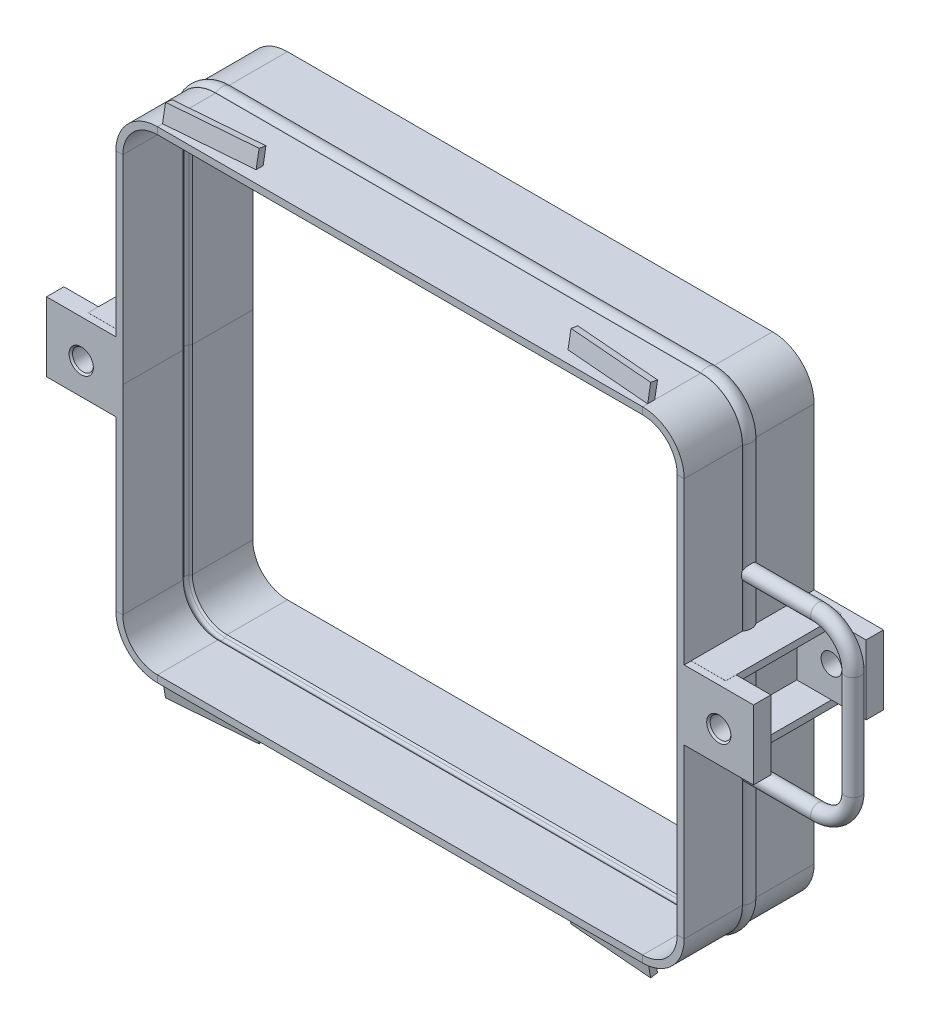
from build123d import *

# Parameters (mm, degrees)
ESQUISSE3_W          = 80
ESQUISSE3_H          = 80
ESQUISSE3_R          = 12
BOSS_EXTRU_1_DEPTH   = 20
BOSS_EXTRU_1_2_DEPTH = 20
CHANFREIN1_SIZE      = 2
CHANFREIN2_SIZE      = 2
ESQUISSE5_R          = 9
BOSS_EXTRU_2_START   = 8
BOSS_EXTRU_2_DEPTH   = 8


with BuildPart() as part:
    # Balayage1: sweep along a path in Esquisse1
    with BuildLine(Plane.XY) as balayage1_path:
        Line((280, -270), (-280, -270))
        ThreePointArc((-280, -270), (-308.284271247, -258.284271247), (-320, -230))
        Line((-320, -230), (-320, 230))
        ThreePointArc((-320, 230), (-308.284271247, 258.284271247), (-280, 270))
        Line((-280, 270), (280, 270))
        ThreePointArc((280, 270), (308.284271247, 258.284271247), (320, 230))
        Line((320, 230), (320, -230))
        ThreePointArc((320, -230), (308.284271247, -258.284271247), (280, -270))
    # Esquisse2 → Balayage1 (sweep)
    with BuildSketch(Plane(origin=(0, 0, 0), x_dir=(1, 0, 0), z_dir=(0, 1, 0))):
        with BuildLine():
            Line((-320, 5.267499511), (-320, 75))
            Line((-320, 75), (-328, 75))
            Line((-328, 75), (-328, 7.81759643))
            Line((-328, 7.81759643), (-328.208677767, 7.52353048))
            ThreePointArc((-328.208677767, 7.52353048), (-330.606843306, -0.000179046), (-328.20828554, -7.523763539))
            Line((-328.20828554, -7.523763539), (-328, -7.817244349))
            Line((-328, -7.817244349), (-328, -75))
            Line((-328, -75), (-320, -75))
            Line((-320, -75), (-320, -5.26691771))
            Line((-320, -5.26691771), (-321.684321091, -2.893656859))
            ThreePointArc((-321.684321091, -2.893656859), (-322.606843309, 2.9484e-05), (-321.684471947, 2.893763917))
            Line((-321.684471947, 2.893763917), (-320, 5.267499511))
        make_face()
    sweep(path=balayage1_path.line)

    # Balayage2: sweep along a path in Esquisse4
    with BuildLine(Plane(origin=(0, 0, 0), x_dir=(-1, 0, 0), z_dir=(0, 0, -1))) as balayage2_path:
        Line((-328, 100), (-408, 100))
        ThreePointArc((-408, 100), (-436.284271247, 88.284271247), (-448, 60))
        Line((-448, 60), (-448, -60))
        ThreePointArc((-448, -60), (-436.284271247, -88.284271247), (-408, -100))
        Line((-408, -100), (-328, -100))
    # Esquisse5 → Balayage2 (sweep)
    with BuildSketch(Plane(origin=(328, 0, 0), x_dir=(0, 0, -1), z_dir=(1, 0, 0))):
        with Locations((0, 100)):
            Circle(ESQUISSE5_R)
    sweep(path=balayage2_path.line)



with BuildPart() as body_2:
    # Esquisse3 → Boss.-Extru.1 (new body)
    with BuildSketch(Plane.XY.offset(75)):
        with Locations((-368, 3.959074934)):
            Rectangle(ESQUISSE3_W, ESQUISSE3_H)
        with Locations((-368, 0)):
            Circle(ESQUISSE3_R, mode=Mode.SUBTRACT)
    extrude(amount=-BOSS_EXTRU_1_DEPTH)

    # Chanfrein1
    chanfrein1_edges = [body_2.edges().sort_by_distance(p)[0] for p in [
        (-380, 0, 75),
    ]]
    chamfer(chanfrein1_edges, length=CHANFREIN1_SIZE)


with BuildPart() as body_3:
    # Esquisse3 → Boss.-Extru.1 2 (new body)
    with BuildSketch(Plane.XY.offset(75)):
        with Locations((368, 3.959074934)):
            Rectangle(ESQUISSE3_W, ESQUISSE3_H)
        with Locations(Location((368, 0, 0), (0, 0, 180))):
            Circle(ESQUISSE3_R, mode=Mode.SUBTRACT)
    extrude(amount=-BOSS_EXTRU_1_2_DEPTH)

    # Chanfrein2
    chanfrein2_edges = [body_3.edges().sort_by_distance(p)[0] for p in [
        (380, 0, 75),
    ]]
    chamfer(chanfrein2_edges, length=CHANFREIN2_SIZE)


with BuildPart() as body_4:
    # Sym_trie1: mirrored copy
    add(body_3.part.mirror(Plane(origin=(0, 0, 0), x_dir=(1, 0, 0), z_dir=(0, 0, -1))))


with BuildPart() as body_5:
    # Sym_trie1 2: mirrored copy
    add(body_2.part.mirror(Plane(origin=(0, 0, 0), x_dir=(1, 0, 0), z_dir=(0, 0, -1))))


with BuildPart() as part_1:
    add(part.part)

    add(body_2.part)  # Boss.-Extru.2 merges body 2

    add(body_3.part)  # Boss.-Extru.2 merges body 3

    add(body_4.part)  # Boss.-Extru.2 merges body 4

    add(body_5.part)  # Boss.-Extru.2 merges body 5
    # Esquisse6 → Boss.-Extru.2 (add)
    with BuildSketch(Plane.XZ.offset(36.040925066).offset(BOSS_EXTRU_2_START)):
        with BuildLine():
            Line((328, -7.81759643), (328, -67))
            Line((328, -67), (368, -67))
            Line((368, -67), (368, 67))
            Line((368, 67), (328, 67))
            Line((328, 67), (328, 7.817244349))
            Line((328, 7.817244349), (328.20828554, 7.523763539))
            ThreePointArc((328.20828554, 7.523763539), (330.606843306, 0.000179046), (328.208677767, -7.52353048))
            Line((328.208677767, -7.52353048), (328, -7.81759643))
        make_face()
        with BuildLine():
            Line((-328, -7.81759643), (-328.208677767, -7.52353048))
            ThreePointArc((-328.208677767, -7.52353048), (-330.606843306, 0.000179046), (-328.20828554, 7.523763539))
            Line((-328.20828554, 7.523763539), (-328, 7.817244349))
            Line((-328, 7.817244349), (-328, 67))
            Line((-328, 67), (-368, 67))
            Line((-368, 67), (-368, -67))
            Line((-368, -67), (-328, -67))
            Line((-328, -67), (-328, -7.81759643))
        make_face()
    boss_extru_2 = extrude(amount=-BOSS_EXTRU_2_DEPTH)

    # Sym_trie2: Boss.-Extru.2 across plane
    add(boss_extru_2.mirror(Plane(origin=(0, 0, 0), x_dir=(0, 0, 1), z_dir=(0, -1, 0))))


with BuildPart() as body_2_2:
    # Balayage3: sweep along a path in Esquisse7
    with BuildLine(Plane.XZ.offset(278)) as balayage3_path:
        Line((-280, 65), (-180, 57))
    # Esquisse9 → Balayage3 (sweep)
    with BuildSketch(Plane(origin=(-280, 0, 0), x_dir=(0, 0, -1), z_dir=(1, 0, 0))):
        Polygon((-69.123412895, -278), (-65.650449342, -297.69615506), (-57.771987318, -296.306969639), (-61, -278), align=None)
    sweep(path=balayage3_path.line)


with BuildPart() as body_3_2:
    # Sym_trie3: mirrored copy
    add(body_2_2.part.mirror(Plane(origin=(0, 0, 0), x_dir=(0, 0, 1), z_dir=(0, -1, 0))))


with BuildPart() as body_4_2:
    # Sym_trie4: mirrored copy
    add(body_2_2.part.mirror(Plane.ZY))


with BuildPart() as body_5_2:
    # Sym_trie4 2: mirrored copy
    add(body_3_2.part.mirror(Plane.ZY))


with BuildPart() as part_2:
    add(part_1.part)

    # Combiner1: union body 3 2, body 5 2, body 4 2, body 2 2
    add(body_3_2.part)
    add(body_5_2.part)
    add(body_4_2.part)
    add(body_2_2.part)


solid = part_2.part
